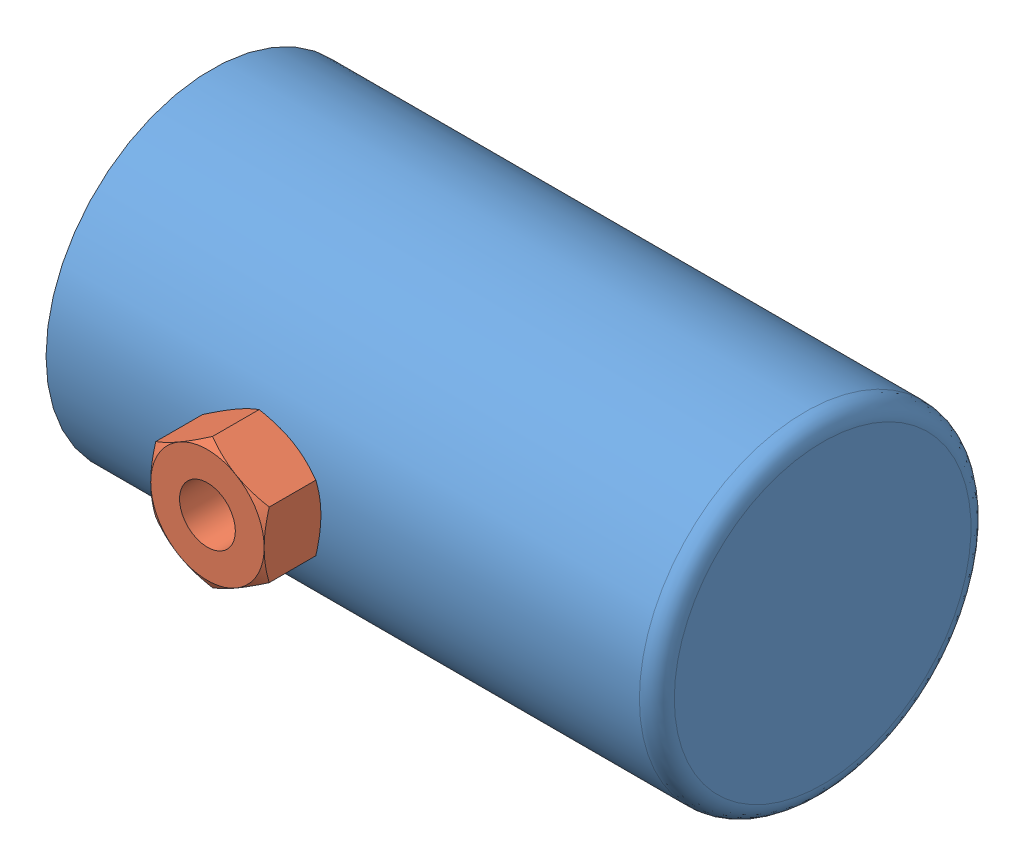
SolidWorks assembly Douille assemblée.SLDASM, configuration Défaut (file format 7000). Lengths in mm.
Overall size (70 38 44.5).
2 component instances, 2 part files, 3 mates.
Components (placement in the parent):
- Douille-1: Douille.SLDPRT [Défaut] at origin size (70 38 38)
- Ecrou hexagonal H - M8-1: Ecrou hexagonal H - M8.SLDPRT [Défaut] at (25 0 25.5) size (13 15.01 6.5)
Mates (geometry in assembly coordinates):
- Tangent1: tangent anti-aligned: cylinder of Douille-1 through (-7.7608 0 0) axis (-1 0 0) radius 19; plane of Ecrou hexagonal H - M8-1 through (18.5 11.2583 19) normal (0 0 -1)
- Coaxiale1: concentric anti-aligned: cylinder of Douille-1 through (25 0 19) axis (0 0 -1) radius 4.25; cylinder of Ecrou hexagonal H - M8-1 through (25 0 7.6863) axis (0 0 1) radius 3.2
- Parallèle1: parallel aligned: plane of Douille-1 through (0 16.2 0) normal (-1 0 0); plane of Ecrou hexagonal H - M8-1 through (18.5 -3.7528 19) normal (-1 0 0)
